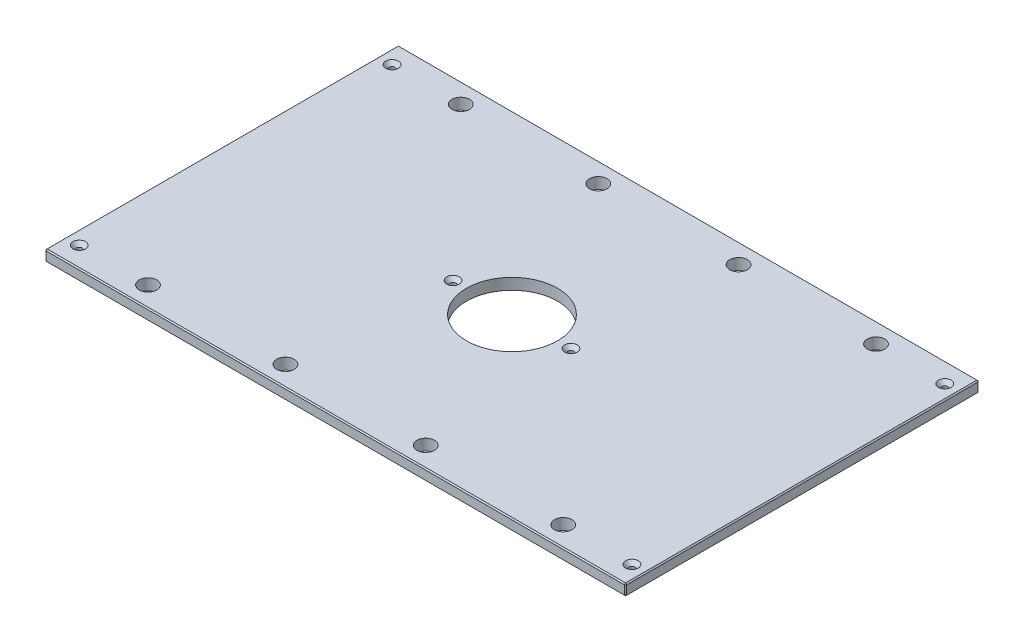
ISO-10303-21;
HEADER;
FILE_DESCRIPTION(('STEP AP214'),'2;1');
FILE_NAME('part.step','',(''),(''),'','','');
FILE_SCHEMA(('AUTOMOTIVE_DESIGN { 1 0 10303 214 1 1 1 1 }'));
ENDSEC;
DATA;
#1=APPLICATION_CONTEXT('core data for automotive mechanical design processes');
#2=APPLICATION_PROTOCOL_DEFINITION('international standard','automotive_design',2000,#1);
#3=PRODUCT_CONTEXT('',#1,'mechanical');
#4=PRODUCT('Part','Part','',(#3));
#5=PRODUCT_RELATED_PRODUCT_CATEGORY('part','',(#4));
#6=PRODUCT_DEFINITION_FORMATION('','',#4);
#7=PRODUCT_DEFINITION_CONTEXT('part definition',#1,'design');
#8=PRODUCT_DEFINITION('design','',#6,#7);
#9=PRODUCT_DEFINITION_SHAPE('','',#8);
#10=(LENGTH_UNIT() NAMED_UNIT(*) SI_UNIT(.MILLI.,.METRE.));
#11=(NAMED_UNIT(*) PLANE_ANGLE_UNIT() SI_UNIT($,.RADIAN.));
#12=(NAMED_UNIT(*) SI_UNIT($,.STERADIAN.) SOLID_ANGLE_UNIT());
#13=UNCERTAINTY_MEASURE_WITH_UNIT(LENGTH_MEASURE(1.E-05),#10,'distance_accuracy_value','');
#14=(GEOMETRIC_REPRESENTATION_CONTEXT(3) GLOBAL_UNCERTAINTY_ASSIGNED_CONTEXT((#13)) GLOBAL_UNIT_ASSIGNED_CONTEXT((#10,
#11,#12)) REPRESENTATION_CONTEXT('',''));
#15=CARTESIAN_POINT('',(0.,0.,0.));
#16=DIRECTION('',(0.,0.,1.));
#17=DIRECTION('',(1.,0.,0.));
#18=AXIS2_PLACEMENT_3D('',#15,#16,#17);
#19=CARTESIAN_POINT('',(-328.6125,12.7,-200.025));
#20=DIRECTION('',(1.,0.,0.));
#21=DIRECTION('',(0.,0.,-1.));
#22=AXIS2_PLACEMENT_3D('',#19,#20,#21);
#23=PLANE('',#22);
#24=DIRECTION('',(0.,0.,-1.));
#25=VECTOR('',#24,1.);
#26=CARTESIAN_POINT('',(-328.6125,11.43,-200.025));
#27=LINE('',#26,#25);
#28=CARTESIAN_POINT('',(-328.6125,11.43,198.755));
#29=VERTEX_POINT('',#28);
#30=CARTESIAN_POINT('',(-328.6125,11.43,-198.755));
#31=VERTEX_POINT('',#30);
#32=EDGE_CURVE('E134',#29,#31,#27,.T.);
#33=ORIENTED_EDGE('',*,*,#32,.T.);
#34=DIRECTION('',(0.,-1.,0.));
#35=VECTOR('',#34,1.);
#36=CARTESIAN_POINT('',(-328.6125,12.7,-198.755));
#37=LINE('',#36,#35);
#38=CARTESIAN_POINT('',(-328.6125,1.26999999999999,-198.755));
#39=VERTEX_POINT('',#38);
#40=EDGE_CURVE('E130',#31,#39,#37,.T.);
#41=ORIENTED_EDGE('',*,*,#40,.T.);
#42=DIRECTION('',(0.,0.,1.));
#43=VECTOR('',#42,1.);
#44=CARTESIAN_POINT('',(-328.6125,1.26999999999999,-200.025));
#45=LINE('',#44,#43);
#46=CARTESIAN_POINT('',(-328.6125,1.26999999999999,198.755));
#47=VERTEX_POINT('',#46);
#48=EDGE_CURVE('E125',#39,#47,#45,.T.);
#49=ORIENTED_EDGE('',*,*,#48,.T.);
#50=DIRECTION('',(0.,1.,0.));
#51=VECTOR('',#50,1.);
#52=CARTESIAN_POINT('',(-328.6125,12.7,198.755));
#53=LINE('',#52,#51);
#54=EDGE_CURVE('E127',#47,#29,#53,.T.);
#55=ORIENTED_EDGE('',*,*,#54,.T.);
#56=EDGE_LOOP('',(#33,#41,#49,#55));
#57=FACE_BOUND('',#56,.T.);
#58=ADVANCED_FACE('F34',(#57),#23,.F.);
#59=CARTESIAN_POINT('',(-328.6125,12.7,200.025));
#60=DIRECTION('',(0.,0.,-1.));
#61=DIRECTION('',(-1.,0.,0.));
#62=AXIS2_PLACEMENT_3D('',#59,#60,#61);
#63=PLANE('',#62);
#64=DIRECTION('',(1.,0.,0.));
#65=VECTOR('',#64,1.);
#66=CARTESIAN_POINT('',(-328.6125,1.26999999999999,200.025));
#67=LINE('',#66,#65);
#68=CARTESIAN_POINT('',(-327.3425,1.26999999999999,200.025));
#69=VERTEX_POINT('',#68);
#70=CARTESIAN_POINT('',(327.3425,1.26999999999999,200.025));
#71=VERTEX_POINT('',#70);
#72=EDGE_CURVE('E57',#69,#71,#67,.T.);
#73=ORIENTED_EDGE('',*,*,#72,.T.);
#74=DIRECTION('',(0.,1.,0.));
#75=VECTOR('',#74,1.);
#76=CARTESIAN_POINT('',(327.3425,12.7,200.025));
#77=LINE('',#76,#75);
#78=CARTESIAN_POINT('',(327.3425,11.43,200.025));
#79=VERTEX_POINT('',#78);
#80=EDGE_CURVE('E11',#71,#79,#77,.T.);
#81=ORIENTED_EDGE('',*,*,#80,.T.);
#82=DIRECTION('',(-1.,0.,0.));
#83=VECTOR('',#82,1.);
#84=CARTESIAN_POINT('',(-328.6125,11.43,200.025));
#85=LINE('',#84,#83);
#86=CARTESIAN_POINT('',(-327.3425,11.43,200.025));
#87=VERTEX_POINT('',#86);
#88=EDGE_CURVE('E43',#79,#87,#85,.T.);
#89=ORIENTED_EDGE('',*,*,#88,.T.);
#90=DIRECTION('',(0.,-1.,0.));
#91=VECTOR('',#90,1.);
#92=CARTESIAN_POINT('',(-327.3425,12.7,200.025));
#93=LINE('',#92,#91);
#94=EDGE_CURVE('E302',#87,#69,#93,.T.);
#95=ORIENTED_EDGE('',*,*,#94,.T.);
#96=EDGE_LOOP('',(#73,#81,#89,#95));
#97=FACE_BOUND('',#96,.T.);
#98=ADVANCED_FACE('F371',(#97),#63,.F.);
#99=CARTESIAN_POINT('',(328.6125,12.7,-200.025));
#100=DIRECTION('',(-1.,0.,0.));
#101=DIRECTION('',(0.,0.,1.));
#102=AXIS2_PLACEMENT_3D('',#99,#100,#101);
#103=PLANE('',#102);
#104=DIRECTION('',(0.,0.,-1.));
#105=VECTOR('',#104,1.);
#106=CARTESIAN_POINT('',(328.6125,1.26999999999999,-200.025));
#107=LINE('',#106,#105);
#108=CARTESIAN_POINT('',(328.6125,1.26999999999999,198.755));
#109=VERTEX_POINT('',#108);
#110=CARTESIAN_POINT('',(328.6125,1.26999999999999,-198.755));
#111=VERTEX_POINT('',#110);
#112=EDGE_CURVE('E297',#109,#111,#107,.T.);
#113=ORIENTED_EDGE('',*,*,#112,.T.);
#114=DIRECTION('',(0.,1.,0.));
#115=VECTOR('',#114,1.);
#116=CARTESIAN_POINT('',(328.6125,12.7,-198.755));
#117=LINE('',#116,#115);
#118=CARTESIAN_POINT('',(328.6125,11.43,-198.755));
#119=VERTEX_POINT('',#118);
#120=EDGE_CURVE('E299',#111,#119,#117,.T.);
#121=ORIENTED_EDGE('',*,*,#120,.T.);
#122=DIRECTION('',(0.,0.,1.));
#123=VECTOR('',#122,1.);
#124=CARTESIAN_POINT('',(328.6125,11.43,200.025));
#125=LINE('',#124,#123);
#126=CARTESIAN_POINT('',(328.6125,11.43,198.755));
#127=VERTEX_POINT('',#126);
#128=EDGE_CURVE('E295',#119,#127,#125,.T.);
#129=ORIENTED_EDGE('',*,*,#128,.T.);
#130=DIRECTION('',(0.,-1.,0.));
#131=VECTOR('',#130,1.);
#132=CARTESIAN_POINT('',(328.6125,12.7,198.755));
#133=LINE('',#132,#131);
#134=EDGE_CURVE('E293',#127,#109,#133,.T.);
#135=ORIENTED_EDGE('',*,*,#134,.T.);
#136=EDGE_LOOP('',(#113,#121,#129,#135));
#137=FACE_BOUND('',#136,.T.);
#138=ADVANCED_FACE('F358',(#137),#103,.F.);
#139=CARTESIAN_POINT('',(-328.6125,12.7,-200.025));
#140=DIRECTION('',(0.,0.,1.));
#141=DIRECTION('',(1.,0.,0.));
#142=AXIS2_PLACEMENT_3D('',#139,#140,#141);
#143=PLANE('',#142);
#144=DIRECTION('',(-1.,0.,0.));
#145=VECTOR('',#144,1.);
#146=CARTESIAN_POINT('',(-328.6125,1.26999999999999,-200.025));
#147=LINE('',#146,#145);
#148=CARTESIAN_POINT('',(327.3425,1.26999999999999,-200.025));
#149=VERTEX_POINT('',#148);
#150=CARTESIAN_POINT('',(-327.3425,1.26999999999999,-200.025));
#151=VERTEX_POINT('',#150);
#152=EDGE_CURVE('E269',#149,#151,#147,.T.);
#153=ORIENTED_EDGE('',*,*,#152,.T.);
#154=DIRECTION('',(0.,1.,0.));
#155=VECTOR('',#154,1.);
#156=CARTESIAN_POINT('',(-327.3425,12.7,-200.025));
#157=LINE('',#156,#155);
#158=CARTESIAN_POINT('',(-327.3425,11.43,-200.025));
#159=VERTEX_POINT('',#158);
#160=EDGE_CURVE('E273',#151,#159,#157,.T.);
#161=ORIENTED_EDGE('',*,*,#160,.T.);
#162=DIRECTION('',(1.,0.,0.));
#163=VECTOR('',#162,1.);
#164=CARTESIAN_POINT('',(328.6125,11.43,-200.025));
#165=LINE('',#164,#163);
#166=CARTESIAN_POINT('',(327.3425,11.43,-200.025));
#167=VERTEX_POINT('',#166);
#168=EDGE_CURVE('E271',#159,#167,#165,.T.);
#169=ORIENTED_EDGE('',*,*,#168,.T.);
#170=DIRECTION('',(0.,-1.,0.));
#171=VECTOR('',#170,1.);
#172=CARTESIAN_POINT('',(327.3425,12.7,-200.025));
#173=LINE('',#172,#171);
#174=EDGE_CURVE('E267',#167,#149,#173,.T.);
#175=ORIENTED_EDGE('',*,*,#174,.T.);
#176=EDGE_LOOP('',(#153,#161,#169,#175));
#177=FACE_BOUND('',#176,.T.);
#178=ADVANCED_FACE('F332',(#177),#143,.F.);
#179=CARTESIAN_POINT('',(0.,12.7,0.));
#180=DIRECTION('',(0.,1.,0.));
#181=DIRECTION('',(0.,0.,1.));
#182=AXIS2_PLACEMENT_3D('',#179,#180,#181);
#183=PLANE('',#182);
#184=CARTESIAN_POINT('',(312.7375,12.7,-177.00498));
#185=DIRECTION('',(0.,1.,0.));
#186=DIRECTION('',(0.,0.,1.));
#187=AXIS2_PLACEMENT_3D('',#184,#185,#186);
#188=CIRCLE('',#187,7.13740000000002);
#189=CARTESIAN_POINT('',(312.7375,12.7,-169.86758));
#190=VERTEX_POINT('',#189);
#191=EDGE_CURVE('E815',#190,#190,#188,.T.);
#192=ORIENTED_EDGE('',*,*,#191,.F.);
#193=EDGE_LOOP('',(#192));
#194=FACE_BOUND('',#193,.T.);
#195=CARTESIAN_POINT('',(312.7375,12.7,177.00498));
#196=DIRECTION('',(0.,1.,0.));
#197=DIRECTION('',(0.,0.,1.));
#198=AXIS2_PLACEMENT_3D('',#195,#196,#197);
#199=CIRCLE('',#198,7.13740000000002);
#200=CARTESIAN_POINT('',(312.7375,12.7,184.14238));
#201=VERTEX_POINT('',#200);
#202=EDGE_CURVE('E819',#201,#201,#199,.T.);
#203=ORIENTED_EDGE('',*,*,#202,.F.);
#204=EDGE_LOOP('',(#203));
#205=FACE_BOUND('',#204,.T.);
#206=CARTESIAN_POINT('',(-312.7375,12.7,177.00498));
#207=DIRECTION('',(0.,1.,0.));
#208=DIRECTION('',(0.,0.,1.));
#209=AXIS2_PLACEMENT_3D('',#206,#207,#208);
#210=CIRCLE('',#209,7.13740000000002);
#211=CARTESIAN_POINT('',(-312.7375,12.7,184.14238));
#212=VERTEX_POINT('',#211);
#213=EDGE_CURVE('E823',#212,#212,#210,.T.);
#214=ORIENTED_EDGE('',*,*,#213,.F.);
#215=EDGE_LOOP('',(#214));
#216=FACE_BOUND('',#215,.T.);
#217=CARTESIAN_POINT('',(-66.675,12.7,0.));
#218=DIRECTION('',(0.,1.,0.));
#219=DIRECTION('',(0.,0.,1.));
#220=AXIS2_PLACEMENT_3D('',#217,#218,#219);
#221=CIRCLE('',#220,7.1374);
#222=CARTESIAN_POINT('',(-66.675,12.7,7.1374));
#223=VERTEX_POINT('',#222);
#224=EDGE_CURVE('E827',#223,#223,#221,.T.);
#225=ORIENTED_EDGE('',*,*,#224,.F.);
#226=EDGE_LOOP('',(#225));
#227=FACE_BOUND('',#226,.T.);
#228=CARTESIAN_POINT('',(66.675,12.7,0.));
#229=DIRECTION('',(0.,1.,0.));
#230=DIRECTION('',(0.,0.,1.));
#231=AXIS2_PLACEMENT_3D('',#228,#229,#230);
#232=CIRCLE('',#231,7.1374);
#233=CARTESIAN_POINT('',(66.675,12.7,7.1374));
#234=VERTEX_POINT('',#233);
#235=EDGE_CURVE('E831',#234,#234,#232,.T.);
#236=ORIENTED_EDGE('',*,*,#235,.F.);
#237=EDGE_LOOP('',(#236));
#238=FACE_BOUND('',#237,.T.);
#239=CARTESIAN_POINT('',(-312.7375,12.7,-177.00498));
#240=DIRECTION('',(0.,1.,0.));
#241=DIRECTION('',(0.,0.,1.));
#242=AXIS2_PLACEMENT_3D('',#239,#240,#241);
#243=CIRCLE('',#242,7.13740000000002);
#244=CARTESIAN_POINT('',(-312.7375,12.7,-169.86758));
#245=VERTEX_POINT('',#244);
#246=EDGE_CURVE('E834',#245,#245,#243,.T.);
#247=ORIENTED_EDGE('',*,*,#246,.F.);
#248=EDGE_LOOP('',(#247));
#249=FACE_BOUND('',#248,.T.);
#250=DIRECTION('',(0.,0.,-1.));
#251=VECTOR('',#250,1.);
#252=CARTESIAN_POINT('',(327.3425,12.7,-200.025));
#253=LINE('',#252,#251);
#254=CARTESIAN_POINT('',(327.3425,12.7,198.755));
#255=VERTEX_POINT('',#254);
#256=CARTESIAN_POINT('',(327.3425,12.7,-198.755));
#257=VERTEX_POINT('',#256);
#258=EDGE_CURVE('E280',#255,#257,#253,.T.);
#259=ORIENTED_EDGE('',*,*,#258,.T.);
#260=DIRECTION('',(-1.,0.,0.));
#261=VECTOR('',#260,1.);
#262=CARTESIAN_POINT('',(-328.6125,12.7,-198.755));
#263=LINE('',#262,#261);
#264=CARTESIAN_POINT('',(-327.3425,12.7,-198.755));
#265=VERTEX_POINT('',#264);
#266=EDGE_CURVE('E282',#257,#265,#263,.T.);
#267=ORIENTED_EDGE('',*,*,#266,.T.);
#268=DIRECTION('',(0.,0.,1.));
#269=VECTOR('',#268,1.);
#270=CARTESIAN_POINT('',(-327.3425,12.7,200.025));
#271=LINE('',#270,#269);
#272=CARTESIAN_POINT('',(-327.3425,12.7,198.755));
#273=VERTEX_POINT('',#272);
#274=EDGE_CURVE('E278',#265,#273,#271,.T.);
#275=ORIENTED_EDGE('',*,*,#274,.T.);
#276=DIRECTION('',(1.,0.,0.));
#277=VECTOR('',#276,1.);
#278=CARTESIAN_POINT('',(328.6125,12.7,198.755));
#279=LINE('',#278,#277);
#280=EDGE_CURVE('E276',#273,#255,#279,.T.);
#281=ORIENTED_EDGE('',*,*,#280,.T.);
#282=EDGE_LOOP('',(#259,#267,#275,#281));
#283=FACE_BOUND('',#282,.T.);
#284=CARTESIAN_POINT('',(234.95,12.7,-177.00498));
#285=DIRECTION('',(0.,1.,0.));
#286=DIRECTION('',(0.,0.,1.));
#287=AXIS2_PLACEMENT_3D('',#284,#285,#286);
#288=CIRCLE('',#287,9.921875);
#289=CARTESIAN_POINT('',(234.95,12.7,-167.083105));
#290=VERTEX_POINT('',#289);
#291=EDGE_CURVE('E203',#290,#290,#288,.T.);
#292=ORIENTED_EDGE('',*,*,#291,.F.);
#293=EDGE_LOOP('',(#292));
#294=FACE_BOUND('',#293,.T.);
#295=CARTESIAN_POINT('',(-234.95,12.7,-177.00498));
#296=DIRECTION('',(0.,1.,0.));
#297=DIRECTION('',(0.,0.,1.));
#298=AXIS2_PLACEMENT_3D('',#295,#296,#297);
#299=CIRCLE('',#298,9.921875);
#300=CARTESIAN_POINT('',(-234.95,12.7,-167.083105));
#301=VERTEX_POINT('',#300);
#302=EDGE_CURVE('E213',#301,#301,#299,.T.);
#303=ORIENTED_EDGE('',*,*,#302,.F.);
#304=EDGE_LOOP('',(#303));
#305=FACE_BOUND('',#304,.T.);
#306=CARTESIAN_POINT('',(234.95,12.7,177.00498));
#307=DIRECTION('',(0.,1.,0.));
#308=DIRECTION('',(0.,0.,1.));
#309=AXIS2_PLACEMENT_3D('',#306,#307,#308);
#310=CIRCLE('',#309,9.921875);
#311=CARTESIAN_POINT('',(234.95,12.7,186.926855));
#312=VERTEX_POINT('',#311);
#313=EDGE_CURVE('E224',#312,#312,#310,.T.);
#314=ORIENTED_EDGE('',*,*,#313,.F.);
#315=EDGE_LOOP('',(#314));
#316=FACE_BOUND('',#315,.T.);
#317=CARTESIAN_POINT('',(-234.95,12.7,177.00498));
#318=DIRECTION('',(0.,1.,0.));
#319=DIRECTION('',(0.,0.,1.));
#320=AXIS2_PLACEMENT_3D('',#317,#318,#319);
#321=CIRCLE('',#320,9.921875);
#322=CARTESIAN_POINT('',(-234.95,12.7,186.926855));
#323=VERTEX_POINT('',#322);
#324=EDGE_CURVE('E230',#323,#323,#321,.T.);
#325=ORIENTED_EDGE('',*,*,#324,.F.);
#326=EDGE_LOOP('',(#325));
#327=FACE_BOUND('',#326,.T.);
#328=CARTESIAN_POINT('',(-79.375,12.7,-177.00498));
#329=DIRECTION('',(0.,1.,0.));
#330=DIRECTION('',(0.,0.,1.));
#331=AXIS2_PLACEMENT_3D('',#328,#329,#330);
#332=CIRCLE('',#331,9.921875);
#333=CARTESIAN_POINT('',(-79.375,12.7,-167.083105));
#334=VERTEX_POINT('',#333);
#335=EDGE_CURVE('E236',#334,#334,#332,.T.);
#336=ORIENTED_EDGE('',*,*,#335,.F.);
#337=EDGE_LOOP('',(#336));
#338=FACE_BOUND('',#337,.T.);
#339=CARTESIAN_POINT('',(79.375,12.7,-177.00498));
#340=DIRECTION('',(0.,1.,0.));
#341=DIRECTION('',(0.,0.,1.));
#342=AXIS2_PLACEMENT_3D('',#339,#340,#341);
#343=CIRCLE('',#342,9.921875);
#344=CARTESIAN_POINT('',(79.375,12.7,-167.083105));
#345=VERTEX_POINT('',#344);
#346=EDGE_CURVE('E242',#345,#345,#343,.T.);
#347=ORIENTED_EDGE('',*,*,#346,.F.);
#348=EDGE_LOOP('',(#347));
#349=FACE_BOUND('',#348,.T.);
#350=CARTESIAN_POINT('',(79.375,12.7,177.00498));
#351=DIRECTION('',(0.,1.,0.));
#352=DIRECTION('',(0.,0.,1.));
#353=AXIS2_PLACEMENT_3D('',#350,#351,#352);
#354=CIRCLE('',#353,9.921875);
#355=CARTESIAN_POINT('',(79.375,12.7,186.926855));
#356=VERTEX_POINT('',#355);
#357=EDGE_CURVE('E248',#356,#356,#354,.T.);
#358=ORIENTED_EDGE('',*,*,#357,.F.);
#359=EDGE_LOOP('',(#358));
#360=FACE_BOUND('',#359,.T.);
#361=CARTESIAN_POINT('',(-79.375,12.7,177.00498));
#362=DIRECTION('',(0.,1.,0.));
#363=DIRECTION('',(0.,0.,1.));
#364=AXIS2_PLACEMENT_3D('',#361,#362,#363);
#365=CIRCLE('',#364,9.921875);
#366=CARTESIAN_POINT('',(-79.375,12.7,186.926855));
#367=VERTEX_POINT('',#366);
#368=EDGE_CURVE('E254',#367,#367,#365,.T.);
#369=ORIENTED_EDGE('',*,*,#368,.F.);
#370=EDGE_LOOP('',(#369));
#371=FACE_BOUND('',#370,.T.);
#372=CARTESIAN_POINT('',(0.,12.7,0.));
#373=DIRECTION('',(0.,1.,0.));
#374=DIRECTION('',(0.,0.,1.));
#375=AXIS2_PLACEMENT_3D('',#372,#373,#374);
#376=CIRCLE('',#375,51.562);
#377=CARTESIAN_POINT('',(0.,12.7,51.562));
#378=VERTEX_POINT('',#377);
#379=EDGE_CURVE('E260',#378,#378,#376,.T.);
#380=ORIENTED_EDGE('',*,*,#379,.F.);
#381=EDGE_LOOP('',(#380));
#382=FACE_BOUND('',#381,.T.);
#383=ADVANCED_FACE('F380',(#194,#205,#216,#227,#238,#249,#283,#294,#305,#316,#327,#338,#349,
#360,#371,#382),#183,.T.);
#384=CARTESIAN_POINT('',(0.,0.,0.));
#385=DIRECTION('',(0.,1.,0.));
#386=DIRECTION('',(0.,0.,1.));
#387=AXIS2_PLACEMENT_3D('',#384,#385,#386);
#388=PLANE('',#387);
#389=CARTESIAN_POINT('',(312.7375,0.,-177.00498));
#390=DIRECTION('',(0.,1.,0.));
#391=DIRECTION('',(0.,0.,1.));
#392=AXIS2_PLACEMENT_3D('',#389,#390,#391);
#393=CIRCLE('',#392,3.3782);
#394=CARTESIAN_POINT('',(312.7375,0.,-173.62678));
#395=VERTEX_POINT('',#394);
#396=EDGE_CURVE('E868',#395,#395,#393,.T.);
#397=ORIENTED_EDGE('',*,*,#396,.T.);
#398=EDGE_LOOP('',(#397));
#399=FACE_BOUND('',#398,.T.);
#400=CARTESIAN_POINT('',(312.7375,0.,177.00498));
#401=DIRECTION('',(0.,1.,0.));
#402=DIRECTION('',(0.,0.,1.));
#403=AXIS2_PLACEMENT_3D('',#400,#401,#402);
#404=CIRCLE('',#403,3.3782);
#405=CARTESIAN_POINT('',(312.7375,0.,180.38318));
#406=VERTEX_POINT('',#405);
#407=EDGE_CURVE('E861',#406,#406,#404,.T.);
#408=ORIENTED_EDGE('',*,*,#407,.T.);
#409=EDGE_LOOP('',(#408));
#410=FACE_BOUND('',#409,.T.);
#411=CARTESIAN_POINT('',(-312.7375,0.,177.00498));
#412=DIRECTION('',(0.,1.,0.));
#413=DIRECTION('',(0.,0.,1.));
#414=AXIS2_PLACEMENT_3D('',#411,#412,#413);
#415=CIRCLE('',#414,3.3782);
#416=CARTESIAN_POINT('',(-312.7375,0.,180.38318));
#417=VERTEX_POINT('',#416);
#418=EDGE_CURVE('E854',#417,#417,#415,.T.);
#419=ORIENTED_EDGE('',*,*,#418,.T.);
#420=EDGE_LOOP('',(#419));
#421=FACE_BOUND('',#420,.T.);
#422=CARTESIAN_POINT('',(-66.675,0.,0.));
#423=DIRECTION('',(0.,1.,0.));
#424=DIRECTION('',(0.,0.,1.));
#425=AXIS2_PLACEMENT_3D('',#422,#423,#424);
#426=CIRCLE('',#425,3.3782);
#427=CARTESIAN_POINT('',(-66.675,0.,3.3782));
#428=VERTEX_POINT('',#427);
#429=EDGE_CURVE('E847',#428,#428,#426,.T.);
#430=ORIENTED_EDGE('',*,*,#429,.T.);
#431=EDGE_LOOP('',(#430));
#432=FACE_BOUND('',#431,.T.);
#433=CARTESIAN_POINT('',(66.675,0.,0.));
#434=DIRECTION('',(0.,1.,0.));
#435=DIRECTION('',(0.,0.,1.));
#436=AXIS2_PLACEMENT_3D('',#433,#434,#435);
#437=CIRCLE('',#436,3.3782);
#438=CARTESIAN_POINT('',(66.675,0.,3.3782));
#439=VERTEX_POINT('',#438);
#440=EDGE_CURVE('E837',#439,#439,#437,.T.);
#441=ORIENTED_EDGE('',*,*,#440,.T.);
#442=EDGE_LOOP('',(#441));
#443=FACE_BOUND('',#442,.T.);
#444=CARTESIAN_POINT('',(-312.7375,0.,-177.00498));
#445=DIRECTION('',(0.,1.,0.));
#446=DIRECTION('',(0.,0.,1.));
#447=AXIS2_PLACEMENT_3D('',#444,#445,#446);
#448=CIRCLE('',#447,3.3782);
#449=CARTESIAN_POINT('',(-312.7375,0.,-173.62678));
#450=VERTEX_POINT('',#449);
#451=EDGE_CURVE('E216',#450,#450,#448,.T.);
#452=ORIENTED_EDGE('',*,*,#451,.T.);
#453=EDGE_LOOP('',(#452));
#454=FACE_BOUND('',#453,.T.);
#455=DIRECTION('',(0.,0.,-1.));
#456=VECTOR('',#455,1.);
#457=CARTESIAN_POINT('',(-327.3425,0.,0.));
#458=LINE('',#457,#456);
#459=CARTESIAN_POINT('',(-327.3425,0.,198.755));
#460=VERTEX_POINT('',#459);
#461=CARTESIAN_POINT('',(-327.3425,0.,-198.755));
#462=VERTEX_POINT('',#461);
#463=EDGE_CURVE('E157',#460,#462,#458,.T.);
#464=ORIENTED_EDGE('',*,*,#463,.T.);
#465=DIRECTION('',(1.,0.,0.));
#466=VECTOR('',#465,1.);
#467=CARTESIAN_POINT('',(0.,0.,-198.755));
#468=LINE('',#467,#466);
#469=CARTESIAN_POINT('',(327.3425,0.,-198.755));
#470=VERTEX_POINT('',#469);
#471=EDGE_CURVE('E290',#462,#470,#468,.T.);
#472=ORIENTED_EDGE('',*,*,#471,.T.);
#473=DIRECTION('',(0.,0.,1.));
#474=VECTOR('',#473,1.);
#475=CARTESIAN_POINT('',(327.3425,0.,0.));
#476=LINE('',#475,#474);
#477=CARTESIAN_POINT('',(327.3425,0.,198.755));
#478=VERTEX_POINT('',#477);
#479=EDGE_CURVE('E288',#470,#478,#476,.T.);
#480=ORIENTED_EDGE('',*,*,#479,.T.);
#481=DIRECTION('',(-1.,0.,0.));
#482=VECTOR('',#481,1.);
#483=CARTESIAN_POINT('',(0.,0.,198.755));
#484=LINE('',#483,#482);
#485=EDGE_CURVE('E285',#478,#460,#484,.T.);
#486=ORIENTED_EDGE('',*,*,#485,.T.);
#487=EDGE_LOOP('',(#464,#472,#480,#486));
#488=FACE_BOUND('',#487,.T.);
#489=CARTESIAN_POINT('',(234.95,0.,-177.00498));
#490=DIRECTION('',(0.,1.,0.));
#491=DIRECTION('',(0.,0.,1.));
#492=AXIS2_PLACEMENT_3D('',#489,#490,#491);
#493=CIRCLE('',#492,9.921875);
#494=CARTESIAN_POINT('',(234.95,0.,-167.083105));
#495=VERTEX_POINT('',#494);
#496=EDGE_CURVE('E208',#495,#495,#493,.T.);
#497=ORIENTED_EDGE('',*,*,#496,.T.);
#498=EDGE_LOOP('',(#497));
#499=FACE_BOUND('',#498,.T.);
#500=CARTESIAN_POINT('',(-234.95,0.,-177.00498));
#501=DIRECTION('',(0.,1.,0.));
#502=DIRECTION('',(0.,0.,1.));
#503=AXIS2_PLACEMENT_3D('',#500,#501,#502);
#504=CIRCLE('',#503,9.921875);
#505=CARTESIAN_POINT('',(-234.95,0.,-167.083105));
#506=VERTEX_POINT('',#505);
#507=EDGE_CURVE('E221',#506,#506,#504,.T.);
#508=ORIENTED_EDGE('',*,*,#507,.T.);
#509=EDGE_LOOP('',(#508));
#510=FACE_BOUND('',#509,.T.);
#511=CARTESIAN_POINT('',(234.95,0.,177.00498));
#512=DIRECTION('',(0.,1.,0.));
#513=DIRECTION('',(0.,0.,1.));
#514=AXIS2_PLACEMENT_3D('',#511,#512,#513);
#515=CIRCLE('',#514,9.921875);
#516=CARTESIAN_POINT('',(234.95,0.,186.926855));
#517=VERTEX_POINT('',#516);
#518=EDGE_CURVE('E227',#517,#517,#515,.T.);
#519=ORIENTED_EDGE('',*,*,#518,.T.);
#520=EDGE_LOOP('',(#519));
#521=FACE_BOUND('',#520,.T.);
#522=CARTESIAN_POINT('',(-234.95,0.,177.00498));
#523=DIRECTION('',(0.,1.,0.));
#524=DIRECTION('',(0.,0.,1.));
#525=AXIS2_PLACEMENT_3D('',#522,#523,#524);
#526=CIRCLE('',#525,9.921875);
#527=CARTESIAN_POINT('',(-234.95,0.,186.926855));
#528=VERTEX_POINT('',#527);
#529=EDGE_CURVE('E233',#528,#528,#526,.T.);
#530=ORIENTED_EDGE('',*,*,#529,.T.);
#531=EDGE_LOOP('',(#530));
#532=FACE_BOUND('',#531,.T.);
#533=CARTESIAN_POINT('',(-79.375,0.,-177.00498));
#534=DIRECTION('',(0.,1.,0.));
#535=DIRECTION('',(0.,0.,1.));
#536=AXIS2_PLACEMENT_3D('',#533,#534,#535);
#537=CIRCLE('',#536,9.921875);
#538=CARTESIAN_POINT('',(-79.375,0.,-167.083105));
#539=VERTEX_POINT('',#538);
#540=EDGE_CURVE('E239',#539,#539,#537,.T.);
#541=ORIENTED_EDGE('',*,*,#540,.T.);
#542=EDGE_LOOP('',(#541));
#543=FACE_BOUND('',#542,.T.);
#544=CARTESIAN_POINT('',(79.375,0.,-177.00498));
#545=DIRECTION('',(0.,1.,0.));
#546=DIRECTION('',(0.,0.,1.));
#547=AXIS2_PLACEMENT_3D('',#544,#545,#546);
#548=CIRCLE('',#547,9.921875);
#549=CARTESIAN_POINT('',(79.375,0.,-167.083105));
#550=VERTEX_POINT('',#549);
#551=EDGE_CURVE('E245',#550,#550,#548,.T.);
#552=ORIENTED_EDGE('',*,*,#551,.T.);
#553=EDGE_LOOP('',(#552));
#554=FACE_BOUND('',#553,.T.);
#555=CARTESIAN_POINT('',(79.375,0.,177.00498));
#556=DIRECTION('',(0.,1.,0.));
#557=DIRECTION('',(0.,0.,1.));
#558=AXIS2_PLACEMENT_3D('',#555,#556,#557);
#559=CIRCLE('',#558,9.921875);
#560=CARTESIAN_POINT('',(79.375,0.,186.926855));
#561=VERTEX_POINT('',#560);
#562=EDGE_CURVE('E251',#561,#561,#559,.T.);
#563=ORIENTED_EDGE('',*,*,#562,.T.);
#564=EDGE_LOOP('',(#563));
#565=FACE_BOUND('',#564,.T.);
#566=CARTESIAN_POINT('',(-79.375,0.,177.00498));
#567=DIRECTION('',(0.,1.,0.));
#568=DIRECTION('',(0.,0.,1.));
#569=AXIS2_PLACEMENT_3D('',#566,#567,#568);
#570=CIRCLE('',#569,9.921875);
#571=CARTESIAN_POINT('',(-79.375,0.,186.926855));
#572=VERTEX_POINT('',#571);
#573=EDGE_CURVE('E257',#572,#572,#570,.T.);
#574=ORIENTED_EDGE('',*,*,#573,.T.);
#575=EDGE_LOOP('',(#574));
#576=FACE_BOUND('',#575,.T.);
#577=CARTESIAN_POINT('',(0.,0.,0.));
#578=DIRECTION('',(0.,1.,0.));
#579=DIRECTION('',(0.,0.,1.));
#580=AXIS2_PLACEMENT_3D('',#577,#578,#579);
#581=CIRCLE('',#580,51.562);
#582=CARTESIAN_POINT('',(0.,0.,51.562));
#583=VERTEX_POINT('',#582);
#584=EDGE_CURVE('E146',#583,#583,#581,.T.);
#585=ORIENTED_EDGE('',*,*,#584,.T.);
#586=EDGE_LOOP('',(#585));
#587=FACE_BOUND('',#586,.T.);
#588=ADVANCED_FACE('F345',(#399,#410,#421,#432,#443,#454,#488,#499,#510,#521,#532,#543,#554,
#565,#576,#587),#388,.F.);
#589=CARTESIAN_POINT('',(0.,0.,0.));
#590=DIRECTION('',(0.,1.,0.));
#591=DIRECTION('',(0.,0.,1.));
#592=AXIS2_PLACEMENT_3D('',#589,#590,#591);
#593=CYLINDRICAL_SURFACE('',#592,51.562);
#594=ORIENTED_EDGE('',*,*,#584,.F.);
#595=EDGE_LOOP('',(#594));
#596=FACE_BOUND('',#595,.T.);
#597=ORIENTED_EDGE('',*,*,#379,.T.);
#598=EDGE_LOOP('',(#597));
#599=FACE_BOUND('',#598,.T.);
#600=ADVANCED_FACE('F750',(#596,#599),#593,.F.);
#601=CARTESIAN_POINT('',(-79.375,12.7,177.00498));
#602=DIRECTION('',(0.,1.,0.));
#603=DIRECTION('',(0.,0.,1.));
#604=AXIS2_PLACEMENT_3D('',#601,#602,#603);
#605=CYLINDRICAL_SURFACE('',#604,9.921875);
#606=ORIENTED_EDGE('',*,*,#573,.F.);
#607=EDGE_LOOP('',(#606));
#608=FACE_BOUND('',#607,.T.);
#609=ORIENTED_EDGE('',*,*,#368,.T.);
#610=EDGE_LOOP('',(#609));
#611=FACE_BOUND('',#610,.T.);
#612=ADVANCED_FACE('F741',(#608,#611),#605,.F.);
#613=CARTESIAN_POINT('',(79.375,12.7,177.00498));
#614=DIRECTION('',(0.,1.,0.));
#615=DIRECTION('',(0.,0.,1.));
#616=AXIS2_PLACEMENT_3D('',#613,#614,#615);
#617=CYLINDRICAL_SURFACE('',#616,9.921875);
#618=ORIENTED_EDGE('',*,*,#562,.F.);
#619=EDGE_LOOP('',(#618));
#620=FACE_BOUND('',#619,.T.);
#621=ORIENTED_EDGE('',*,*,#357,.T.);
#622=EDGE_LOOP('',(#621));
#623=FACE_BOUND('',#622,.T.);
#624=ADVANCED_FACE('F732',(#620,#623),#617,.F.);
#625=CARTESIAN_POINT('',(79.375,12.7,-177.00498));
#626=DIRECTION('',(0.,1.,0.));
#627=DIRECTION('',(0.,0.,1.));
#628=AXIS2_PLACEMENT_3D('',#625,#626,#627);
#629=CYLINDRICAL_SURFACE('',#628,9.921875);
#630=ORIENTED_EDGE('',*,*,#551,.F.);
#631=EDGE_LOOP('',(#630));
#632=FACE_BOUND('',#631,.T.);
#633=ORIENTED_EDGE('',*,*,#346,.T.);
#634=EDGE_LOOP('',(#633));
#635=FACE_BOUND('',#634,.T.);
#636=ADVANCED_FACE('F723',(#632,#635),#629,.F.);
#637=CARTESIAN_POINT('',(-79.375,12.7,-177.00498));
#638=DIRECTION('',(0.,1.,0.));
#639=DIRECTION('',(0.,0.,1.));
#640=AXIS2_PLACEMENT_3D('',#637,#638,#639);
#641=CYLINDRICAL_SURFACE('',#640,9.921875);
#642=ORIENTED_EDGE('',*,*,#540,.F.);
#643=EDGE_LOOP('',(#642));
#644=FACE_BOUND('',#643,.T.);
#645=ORIENTED_EDGE('',*,*,#335,.T.);
#646=EDGE_LOOP('',(#645));
#647=FACE_BOUND('',#646,.T.);
#648=ADVANCED_FACE('F714',(#644,#647),#641,.F.);
#649=CARTESIAN_POINT('',(-234.95,12.7,177.00498));
#650=DIRECTION('',(0.,1.,0.));
#651=DIRECTION('',(0.,0.,1.));
#652=AXIS2_PLACEMENT_3D('',#649,#650,#651);
#653=CYLINDRICAL_SURFACE('',#652,9.921875);
#654=ORIENTED_EDGE('',*,*,#529,.F.);
#655=EDGE_LOOP('',(#654));
#656=FACE_BOUND('',#655,.T.);
#657=ORIENTED_EDGE('',*,*,#324,.T.);
#658=EDGE_LOOP('',(#657));
#659=FACE_BOUND('',#658,.T.);
#660=ADVANCED_FACE('F705',(#656,#659),#653,.F.);
#661=CARTESIAN_POINT('',(234.95,12.7,177.00498));
#662=DIRECTION('',(0.,1.,0.));
#663=DIRECTION('',(0.,0.,1.));
#664=AXIS2_PLACEMENT_3D('',#661,#662,#663);
#665=CYLINDRICAL_SURFACE('',#664,9.921875);
#666=ORIENTED_EDGE('',*,*,#518,.F.);
#667=EDGE_LOOP('',(#666));
#668=FACE_BOUND('',#667,.T.);
#669=ORIENTED_EDGE('',*,*,#313,.T.);
#670=EDGE_LOOP('',(#669));
#671=FACE_BOUND('',#670,.T.);
#672=ADVANCED_FACE('F696',(#668,#671),#665,.F.);
#673=CARTESIAN_POINT('',(-234.95,12.7,-177.00498));
#674=DIRECTION('',(0.,1.,0.));
#675=DIRECTION('',(0.,0.,1.));
#676=AXIS2_PLACEMENT_3D('',#673,#674,#675);
#677=CYLINDRICAL_SURFACE('',#676,9.921875);
#678=ORIENTED_EDGE('',*,*,#507,.F.);
#679=EDGE_LOOP('',(#678));
#680=FACE_BOUND('',#679,.T.);
#681=ORIENTED_EDGE('',*,*,#302,.T.);
#682=EDGE_LOOP('',(#681));
#683=FACE_BOUND('',#682,.T.);
#684=ADVANCED_FACE('F686',(#680,#683),#677,.F.);
#685=CARTESIAN_POINT('',(234.95,12.7,-177.00498));
#686=DIRECTION('',(0.,1.,0.));
#687=DIRECTION('',(0.,0.,1.));
#688=AXIS2_PLACEMENT_3D('',#685,#686,#687);
#689=CYLINDRICAL_SURFACE('',#688,9.921875);
#690=ORIENTED_EDGE('',*,*,#496,.F.);
#691=EDGE_LOOP('',(#690));
#692=FACE_BOUND('',#691,.T.);
#693=ORIENTED_EDGE('',*,*,#291,.T.);
#694=EDGE_LOOP('',(#693));
#695=FACE_BOUND('',#694,.T.);
#696=ADVANCED_FACE('F389',(#692,#695),#689,.F.);
#697=CARTESIAN_POINT('',(328.6125,12.7,198.755));
#698=DIRECTION('',(-0.707106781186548,0.,-0.707106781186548));
#699=DIRECTION('',(0.,-1.,0.));
#700=AXIS2_PLACEMENT_3D('',#697,#698,#699);
#701=PLANE('',#700);
#702=DIRECTION('',(-0.707106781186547,0.,0.707106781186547));
#703=VECTOR('',#702,1.);
#704=CARTESIAN_POINT('',(328.6125,11.43,198.755));
#705=LINE('',#704,#703);
#706=EDGE_CURVE('E38',#79,#127,#705,.F.);
#707=ORIENTED_EDGE('',*,*,#706,.F.);
#708=ORIENTED_EDGE('',*,*,#80,.F.);
#709=DIRECTION('',(0.707106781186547,0.,-0.707106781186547));
#710=VECTOR('',#709,1.);
#711=CARTESIAN_POINT('',(327.9775,1.26999999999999,199.39));
#712=LINE('',#711,#710);
#713=EDGE_CURVE('E196',#109,#71,#712,.F.);
#714=ORIENTED_EDGE('',*,*,#713,.F.);
#715=ORIENTED_EDGE('',*,*,#134,.F.);
#716=EDGE_LOOP('',(#707,#708,#714,#715));
#717=FACE_BOUND('',#716,.T.);
#718=ADVANCED_FACE('F36',(#717),#701,.F.);
#719=CARTESIAN_POINT('',(328.6125,11.43,198.755));
#720=DIRECTION('',(0.577350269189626,0.577350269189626,0.577350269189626));
#721=DIRECTION('',(0.707106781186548,0.,-0.707106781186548));
#722=AXIS2_PLACEMENT_3D('',#719,#720,#721);
#723=PLANE('',#722);
#724=DIRECTION('',(0.,-0.707106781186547,0.707106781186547));
#725=VECTOR('',#724,1.);
#726=CARTESIAN_POINT('',(327.3425,12.065,199.39));
#727=LINE('',#726,#725);
#728=EDGE_CURVE('E192',#79,#255,#727,.F.);
#729=ORIENTED_EDGE('',*,*,#728,.F.);
#730=ORIENTED_EDGE('',*,*,#706,.T.);
#731=DIRECTION('',(-0.707106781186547,0.707106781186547,0.));
#732=VECTOR('',#731,1.);
#733=CARTESIAN_POINT('',(328.6125,11.43,198.755));
#734=LINE('',#733,#732);
#735=EDGE_CURVE('E194',#255,#127,#734,.F.);
#736=ORIENTED_EDGE('',*,*,#735,.F.);
#737=EDGE_LOOP('',(#729,#730,#736));
#738=FACE_BOUND('',#737,.T.);
#739=ADVANCED_FACE('F382',(#738),#723,.T.);
#740=CARTESIAN_POINT('',(327.3425,0.,198.755));
#741=DIRECTION('',(0.577350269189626,-0.577350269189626,0.577350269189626));
#742=DIRECTION('',(0.707106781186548,0.,-0.707106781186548));
#743=AXIS2_PLACEMENT_3D('',#740,#741,#742);
#744=PLANE('',#743);
#745=DIRECTION('',(-0.707106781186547,-0.707106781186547,0.));
#746=VECTOR('',#745,1.);
#747=CARTESIAN_POINT('',(327.3425,0.,198.755));
#748=LINE('',#747,#746);
#749=EDGE_CURVE('E186',#109,#478,#748,.T.);
#750=ORIENTED_EDGE('',*,*,#749,.F.);
#751=ORIENTED_EDGE('',*,*,#713,.T.);
#752=DIRECTION('',(0.,0.707106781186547,0.707106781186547));
#753=VECTOR('',#752,1.);
#754=CARTESIAN_POINT('',(327.3425,0.,198.755));
#755=LINE('',#754,#753);
#756=EDGE_CURVE('E189',#478,#71,#755,.T.);
#757=ORIENTED_EDGE('',*,*,#756,.F.);
#758=EDGE_LOOP('',(#750,#751,#757));
#759=FACE_BOUND('',#758,.T.);
#760=ADVANCED_FACE('F351',(#759),#744,.T.);
#761=CARTESIAN_POINT('',(327.3425,12.7,0.));
#762=DIRECTION('',(0.707106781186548,0.707106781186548,0.));
#763=DIRECTION('',(0.,0.,1.));
#764=AXIS2_PLACEMENT_3D('',#761,#762,#763);
#765=PLANE('',#764);
#766=ORIENTED_EDGE('',*,*,#735,.T.);
#767=ORIENTED_EDGE('',*,*,#128,.F.);
#768=DIRECTION('',(0.707106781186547,-0.707106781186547,0.));
#769=VECTOR('',#768,1.);
#770=CARTESIAN_POINT('',(327.9775,12.065,-198.755));
#771=LINE('',#770,#769);
#772=EDGE_CURVE('E181',#257,#119,#771,.T.);
#773=ORIENTED_EDGE('',*,*,#772,.F.);
#774=ORIENTED_EDGE('',*,*,#258,.F.);
#775=EDGE_LOOP('',(#766,#767,#773,#774));
#776=FACE_BOUND('',#775,.T.);
#777=ADVANCED_FACE('F368',(#776),#765,.T.);
#778=CARTESIAN_POINT('',(0.,12.7,198.755));
#779=DIRECTION('',(0.,0.707106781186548,0.707106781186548));
#780=DIRECTION('',(-1.,0.,0.));
#781=AXIS2_PLACEMENT_3D('',#778,#779,#780);
#782=PLANE('',#781);
#783=ORIENTED_EDGE('',*,*,#728,.T.);
#784=ORIENTED_EDGE('',*,*,#280,.F.);
#785=DIRECTION('',(0.,0.707106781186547,-0.707106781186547));
#786=VECTOR('',#785,1.);
#787=CARTESIAN_POINT('',(-327.3425,12.7,198.755));
#788=LINE('',#787,#786);
#789=EDGE_CURVE('E178',#87,#273,#788,.T.);
#790=ORIENTED_EDGE('',*,*,#789,.F.);
#791=ORIENTED_EDGE('',*,*,#88,.F.);
#792=EDGE_LOOP('',(#783,#784,#790,#791));
#793=FACE_BOUND('',#792,.T.);
#794=ADVANCED_FACE('F373',(#793),#782,.T.);
#795=CARTESIAN_POINT('',(-327.3425,12.7,200.025));
#796=DIRECTION('',(0.707106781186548,0.,-0.707106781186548));
#797=DIRECTION('',(0.,-1.,0.));
#798=AXIS2_PLACEMENT_3D('',#795,#796,#797);
#799=PLANE('',#798);
#800=DIRECTION('',(0.707106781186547,0.,0.707106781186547));
#801=VECTOR('',#800,1.);
#802=CARTESIAN_POINT('',(-328.6125,1.26999999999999,198.755));
#803=LINE('',#802,#801);
#804=EDGE_CURVE('E141',#69,#47,#803,.F.);
#805=ORIENTED_EDGE('',*,*,#804,.F.);
#806=ORIENTED_EDGE('',*,*,#94,.F.);
#807=DIRECTION('',(-0.707106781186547,0.,-0.707106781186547));
#808=VECTOR('',#807,1.);
#809=CARTESIAN_POINT('',(-327.9775,11.43,199.39));
#810=LINE('',#809,#808);
#811=EDGE_CURVE('E144',#29,#87,#810,.F.);
#812=ORIENTED_EDGE('',*,*,#811,.F.);
#813=ORIENTED_EDGE('',*,*,#54,.F.);
#814=EDGE_LOOP('',(#805,#806,#812,#813));
#815=FACE_BOUND('',#814,.T.);
#816=ADVANCED_FACE('F139',(#815),#799,.F.);
#817=CARTESIAN_POINT('',(-328.6125,1.26999999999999,200.025));
#818=DIRECTION('',(0.,0.707106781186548,-0.707106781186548));
#819=DIRECTION('',(1.,0.,0.));
#820=AXIS2_PLACEMENT_3D('',#817,#818,#819);
#821=PLANE('',#820);
#822=ORIENTED_EDGE('',*,*,#756,.T.);
#823=ORIENTED_EDGE('',*,*,#72,.F.);
#824=DIRECTION('',(0.,-0.707106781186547,-0.707106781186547));
#825=VECTOR('',#824,1.);
#826=CARTESIAN_POINT('',(-327.3425,0.634999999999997,199.39));
#827=LINE('',#826,#825);
#828=EDGE_CURVE('E154',#460,#69,#827,.F.);
#829=ORIENTED_EDGE('',*,*,#828,.F.);
#830=ORIENTED_EDGE('',*,*,#485,.F.);
#831=EDGE_LOOP('',(#822,#823,#829,#830));
#832=FACE_BOUND('',#831,.T.);
#833=ADVANCED_FACE('F350',(#832),#821,.F.);
#834=CARTESIAN_POINT('',(328.6125,1.26999999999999,-200.025));
#835=DIRECTION('',(-0.707106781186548,0.707106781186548,0.));
#836=DIRECTION('',(0.,0.,-1.));
#837=AXIS2_PLACEMENT_3D('',#834,#835,#836);
#838=PLANE('',#837);
#839=ORIENTED_EDGE('',*,*,#749,.T.);
#840=ORIENTED_EDGE('',*,*,#479,.F.);
#841=DIRECTION('',(0.707106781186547,0.707106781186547,0.));
#842=VECTOR('',#841,1.);
#843=CARTESIAN_POINT('',(327.3425,0.,-198.755));
#844=LINE('',#843,#842);
#845=EDGE_CURVE('E173',#111,#470,#844,.F.);
#846=ORIENTED_EDGE('',*,*,#845,.F.);
#847=ORIENTED_EDGE('',*,*,#112,.F.);
#848=EDGE_LOOP('',(#839,#840,#846,#847));
#849=FACE_BOUND('',#848,.T.);
#850=ADVANCED_FACE('F355',(#849),#838,.F.);
#851=CARTESIAN_POINT('',(327.3425,12.7,-200.025));
#852=DIRECTION('',(-0.707106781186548,0.,0.707106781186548));
#853=DIRECTION('',(0.,-1.,0.));
#854=AXIS2_PLACEMENT_3D('',#851,#852,#853);
#855=PLANE('',#854);
#856=DIRECTION('',(0.707106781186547,0.,0.707106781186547));
#857=VECTOR('',#856,1.);
#858=CARTESIAN_POINT('',(327.3425,11.43,-200.025));
#859=LINE('',#858,#857);
#860=EDGE_CURVE('E183',#119,#167,#859,.F.);
#861=ORIENTED_EDGE('',*,*,#860,.F.);
#862=ORIENTED_EDGE('',*,*,#120,.F.);
#863=DIRECTION('',(-0.707106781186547,0.,-0.707106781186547));
#864=VECTOR('',#863,1.);
#865=CARTESIAN_POINT('',(327.9775,1.26999999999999,-199.39));
#866=LINE('',#865,#864);
#867=EDGE_CURVE('E170',#149,#111,#866,.F.);
#868=ORIENTED_EDGE('',*,*,#867,.F.);
#869=ORIENTED_EDGE('',*,*,#174,.F.);
#870=EDGE_LOOP('',(#861,#862,#868,#869));
#871=FACE_BOUND('',#870,.T.);
#872=ADVANCED_FACE('F363',(#871),#855,.F.);
#873=CARTESIAN_POINT('',(327.3425,11.43,-200.025));
#874=DIRECTION('',(0.577350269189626,0.577350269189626,-0.577350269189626));
#875=DIRECTION('',(-0.707106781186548,0.,-0.707106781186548));
#876=AXIS2_PLACEMENT_3D('',#873,#874,#875);
#877=PLANE('',#876);
#878=ORIENTED_EDGE('',*,*,#772,.T.);
#879=ORIENTED_EDGE('',*,*,#860,.T.);
#880=DIRECTION('',(0.,0.707106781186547,0.707106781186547));
#881=VECTOR('',#880,1.);
#882=CARTESIAN_POINT('',(327.3425,11.43,-200.025));
#883=LINE('',#882,#881);
#884=EDGE_CURVE('E162',#257,#167,#883,.F.);
#885=ORIENTED_EDGE('',*,*,#884,.F.);
#886=EDGE_LOOP('',(#878,#879,#885));
#887=FACE_BOUND('',#886,.T.);
#888=ADVANCED_FACE('F421',(#887),#877,.T.);
#889=CARTESIAN_POINT('',(-327.3425,12.7,198.755));
#890=DIRECTION('',(-0.577350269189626,0.577350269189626,0.577350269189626));
#891=DIRECTION('',(0.707106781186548,0.,0.707106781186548));
#892=AXIS2_PLACEMENT_3D('',#889,#890,#891);
#893=PLANE('',#892);
#894=ORIENTED_EDGE('',*,*,#811,.T.);
#895=ORIENTED_EDGE('',*,*,#789,.T.);
#896=DIRECTION('',(-0.707106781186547,-0.707106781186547,0.));
#897=VECTOR('',#896,1.);
#898=CARTESIAN_POINT('',(-327.3425,12.7,198.755));
#899=LINE('',#898,#897);
#900=EDGE_CURVE('E158',#29,#273,#899,.F.);
#901=ORIENTED_EDGE('',*,*,#900,.F.);
#902=EDGE_LOOP('',(#894,#895,#901));
#903=FACE_BOUND('',#902,.T.);
#904=ADVANCED_FACE('F375',(#903),#893,.T.);
#905=CARTESIAN_POINT('',(-328.6125,1.26999999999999,198.755));
#906=DIRECTION('',(-0.577350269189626,-0.577350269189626,0.577350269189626));
#907=DIRECTION('',(0.707106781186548,0.,0.707106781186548));
#908=AXIS2_PLACEMENT_3D('',#905,#906,#907);
#909=PLANE('',#908);
#910=ORIENTED_EDGE('',*,*,#828,.T.);
#911=ORIENTED_EDGE('',*,*,#804,.T.);
#912=DIRECTION('',(-0.707106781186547,0.707106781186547,0.));
#913=VECTOR('',#912,1.);
#914=CARTESIAN_POINT('',(-328.6125,1.26999999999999,198.755));
#915=LINE('',#914,#913);
#916=EDGE_CURVE('E151',#460,#47,#915,.T.);
#917=ORIENTED_EDGE('',*,*,#916,.F.);
#918=EDGE_LOOP('',(#910,#911,#917));
#919=FACE_BOUND('',#918,.T.);
#920=ADVANCED_FACE('F150',(#919),#909,.T.);
#921=CARTESIAN_POINT('',(327.3425,0.,-198.755));
#922=DIRECTION('',(0.577350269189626,-0.577350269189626,-0.577350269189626));
#923=DIRECTION('',(-0.707106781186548,0.,-0.707106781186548));
#924=AXIS2_PLACEMENT_3D('',#921,#922,#923);
#925=PLANE('',#924);
#926=ORIENTED_EDGE('',*,*,#867,.T.);
#927=ORIENTED_EDGE('',*,*,#845,.T.);
#928=DIRECTION('',(0.,-0.707106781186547,0.707106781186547));
#929=VECTOR('',#928,1.);
#930=CARTESIAN_POINT('',(327.3425,0.,-198.755));
#931=LINE('',#930,#929);
#932=EDGE_CURVE('E159',#149,#470,#931,.T.);
#933=ORIENTED_EDGE('',*,*,#932,.F.);
#934=EDGE_LOOP('',(#926,#927,#933));
#935=FACE_BOUND('',#934,.T.);
#936=ADVANCED_FACE('F413',(#935),#925,.T.);
#937=CARTESIAN_POINT('',(0.,12.7,-198.755));
#938=DIRECTION('',(0.,0.707106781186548,-0.707106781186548));
#939=DIRECTION('',(1.,0.,0.));
#940=AXIS2_PLACEMENT_3D('',#937,#938,#939);
#941=PLANE('',#940);
#942=ORIENTED_EDGE('',*,*,#884,.T.);
#943=ORIENTED_EDGE('',*,*,#168,.F.);
#944=DIRECTION('',(0.,-0.707106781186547,-0.707106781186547));
#945=VECTOR('',#944,1.);
#946=CARTESIAN_POINT('',(-327.3425,11.43,-200.025));
#947=LINE('',#946,#945);
#948=EDGE_CURVE('E164',#265,#159,#947,.T.);
#949=ORIENTED_EDGE('',*,*,#948,.F.);
#950=ORIENTED_EDGE('',*,*,#266,.F.);
#951=EDGE_LOOP('',(#942,#943,#949,#950));
#952=FACE_BOUND('',#951,.T.);
#953=ADVANCED_FACE('F327',(#952),#941,.T.);
#954=CARTESIAN_POINT('',(-327.3425,12.7,0.));
#955=DIRECTION('',(-0.707106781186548,0.707106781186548,0.));
#956=DIRECTION('',(0.,0.,-1.));
#957=AXIS2_PLACEMENT_3D('',#954,#955,#956);
#958=PLANE('',#957);
#959=ORIENTED_EDGE('',*,*,#900,.T.);
#960=ORIENTED_EDGE('',*,*,#274,.F.);
#961=DIRECTION('',(0.707106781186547,0.707106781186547,0.));
#962=VECTOR('',#961,1.);
#963=CARTESIAN_POINT('',(-327.9775,12.065,-198.755));
#964=LINE('',#963,#962);
#965=EDGE_CURVE('E316',#31,#265,#964,.T.);
#966=ORIENTED_EDGE('',*,*,#965,.F.);
#967=ORIENTED_EDGE('',*,*,#32,.F.);
#968=EDGE_LOOP('',(#959,#960,#966,#967));
#969=FACE_BOUND('',#968,.T.);
#970=ADVANCED_FACE('F378',(#969),#958,.T.);
#971=CARTESIAN_POINT('',(-328.6125,1.26999999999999,-200.025));
#972=DIRECTION('',(0.707106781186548,0.707106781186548,0.));
#973=DIRECTION('',(0.,0.,1.));
#974=AXIS2_PLACEMENT_3D('',#971,#972,#973);
#975=PLANE('',#974);
#976=ORIENTED_EDGE('',*,*,#916,.T.);
#977=ORIENTED_EDGE('',*,*,#48,.F.);
#978=DIRECTION('',(0.707106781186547,-0.707106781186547,0.));
#979=VECTOR('',#978,1.);
#980=CARTESIAN_POINT('',(-328.6125,1.26999999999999,-198.755));
#981=LINE('',#980,#979);
#982=EDGE_CURVE('E313',#462,#39,#981,.F.);
#983=ORIENTED_EDGE('',*,*,#982,.F.);
#984=ORIENTED_EDGE('',*,*,#463,.F.);
#985=EDGE_LOOP('',(#976,#977,#983,#984));
#986=FACE_BOUND('',#985,.T.);
#987=ADVANCED_FACE('F156',(#986),#975,.F.);
#988=CARTESIAN_POINT('',(-328.6125,1.26999999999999,-200.025));
#989=DIRECTION('',(0.,0.707106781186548,0.707106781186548));
#990=DIRECTION('',(-1.,0.,0.));
#991=AXIS2_PLACEMENT_3D('',#988,#989,#990);
#992=PLANE('',#991);
#993=ORIENTED_EDGE('',*,*,#932,.T.);
#994=ORIENTED_EDGE('',*,*,#471,.F.);
#995=DIRECTION('',(0.,0.707106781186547,-0.707106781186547));
#996=VECTOR('',#995,1.);
#997=CARTESIAN_POINT('',(-327.3425,0.634999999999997,-199.39));
#998=LINE('',#997,#996);
#999=EDGE_CURVE('E310',#151,#462,#998,.F.);
#1000=ORIENTED_EDGE('',*,*,#999,.F.);
#1001=ORIENTED_EDGE('',*,*,#152,.F.);
#1002=EDGE_LOOP('',(#993,#994,#1000,#1001));
#1003=FACE_BOUND('',#1002,.T.);
#1004=ADVANCED_FACE('F342',(#1003),#992,.F.);
#1005=CARTESIAN_POINT('',(-327.3425,11.43,-200.025));
#1006=DIRECTION('',(-0.577350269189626,0.577350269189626,-0.577350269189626));
#1007=DIRECTION('',(-0.707106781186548,0.,0.707106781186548));
#1008=AXIS2_PLACEMENT_3D('',#1005,#1006,#1007);
#1009=PLANE('',#1008);
#1010=ORIENTED_EDGE('',*,*,#965,.T.);
#1011=ORIENTED_EDGE('',*,*,#948,.T.);
#1012=DIRECTION('',(0.707106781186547,0.,-0.707106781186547));
#1013=VECTOR('',#1012,1.);
#1014=CARTESIAN_POINT('',(-327.3425,11.43,-200.025));
#1015=LINE('',#1014,#1013);
#1016=EDGE_CURVE('E308',#31,#159,#1015,.T.);
#1017=ORIENTED_EDGE('',*,*,#1016,.F.);
#1018=EDGE_LOOP('',(#1010,#1011,#1017));
#1019=FACE_BOUND('',#1018,.T.);
#1020=ADVANCED_FACE('F322',(#1019),#1009,.T.);
#1021=CARTESIAN_POINT('',(-328.6125,1.26999999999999,-198.755));
#1022=DIRECTION('',(-0.577350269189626,-0.577350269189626,-0.577350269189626));
#1023=DIRECTION('',(-0.707106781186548,0.,0.707106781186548));
#1024=AXIS2_PLACEMENT_3D('',#1021,#1022,#1023);
#1025=PLANE('',#1024);
#1026=ORIENTED_EDGE('',*,*,#999,.T.);
#1027=ORIENTED_EDGE('',*,*,#982,.T.);
#1028=DIRECTION('',(-0.707106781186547,0.,0.707106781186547));
#1029=VECTOR('',#1028,1.);
#1030=CARTESIAN_POINT('',(-328.6125,1.26999999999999,-198.755));
#1031=LINE('',#1030,#1029);
#1032=EDGE_CURVE('E306',#151,#39,#1031,.T.);
#1033=ORIENTED_EDGE('',*,*,#1032,.F.);
#1034=EDGE_LOOP('',(#1026,#1027,#1033));
#1035=FACE_BOUND('',#1034,.T.);
#1036=ADVANCED_FACE('F339',(#1035),#1025,.T.);
#1037=CARTESIAN_POINT('',(-328.6125,12.7,-198.755));
#1038=DIRECTION('',(0.707106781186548,0.,0.707106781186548));
#1039=DIRECTION('',(0.,-1.,0.));
#1040=AXIS2_PLACEMENT_3D('',#1037,#1038,#1039);
#1041=PLANE('',#1040);
#1042=ORIENTED_EDGE('',*,*,#1016,.T.);
#1043=ORIENTED_EDGE('',*,*,#160,.F.);
#1044=ORIENTED_EDGE('',*,*,#1032,.T.);
#1045=ORIENTED_EDGE('',*,*,#40,.F.);
#1046=EDGE_LOOP('',(#1042,#1043,#1044,#1045));
#1047=FACE_BOUND('',#1046,.T.);
#1048=ADVANCED_FACE('F337',(#1047),#1041,.F.);
#1049=CARTESIAN_POINT('',(-312.7375,12.7,-177.00498));
#1050=DIRECTION('',(0.,1.,0.));
#1051=DIRECTION('',(0.,0.,1.));
#1052=AXIS2_PLACEMENT_3D('',#1049,#1050,#1051);
#1053=CYLINDRICAL_SURFACE('',#1052,3.3782);
#1054=ORIENTED_EDGE('',*,*,#451,.F.);
#1055=EDGE_LOOP('',(#1054));
#1056=FACE_BOUND('',#1055,.T.);
#1057=CARTESIAN_POINT('',(-312.7375,8.37553508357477,-177.00498));
#1058=DIRECTION('',(0.,1.,0.));
#1059=DIRECTION('',(0.,0.,1.));
#1060=AXIS2_PLACEMENT_3D('',#1057,#1058,#1059);
#1061=CIRCLE('',#1060,3.3782);
#1062=CARTESIAN_POINT('',(-312.7375,8.37553508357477,-173.62678));
#1063=VERTEX_POINT('',#1062);
#1064=EDGE_CURVE('E836',#1063,#1063,#1061,.T.);
#1065=ORIENTED_EDGE('',*,*,#1064,.T.);
#1066=EDGE_LOOP('',(#1065));
#1067=FACE_BOUND('',#1066,.T.);
#1068=ADVANCED_FACE('F400',(#1056,#1067),#1053,.F.);
#1069=CARTESIAN_POINT('',(-312.7375,12.7,-177.00498));
#1070=DIRECTION('',(0.,1.,0.));
#1071=DIRECTION('',(0.,0.,1.));
#1072=AXIS2_PLACEMENT_3D('',#1069,#1070,#1071);
#1073=CONICAL_SURFACE('',#1072,7.13740000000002,0.715584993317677);
#1074=ORIENTED_EDGE('',*,*,#1064,.F.);
#1075=EDGE_LOOP('',(#1074));
#1076=FACE_BOUND('',#1075,.T.);
#1077=ORIENTED_EDGE('',*,*,#246,.T.);
#1078=EDGE_LOOP('',(#1077));
#1079=FACE_BOUND('',#1078,.T.);
#1080=ADVANCED_FACE('F510',(#1076,#1079),#1073,.F.);
#1081=CARTESIAN_POINT('',(66.675,12.7,0.));
#1082=DIRECTION('',(0.,1.,0.));
#1083=DIRECTION('',(0.,0.,1.));
#1084=AXIS2_PLACEMENT_3D('',#1081,#1082,#1083);
#1085=CYLINDRICAL_SURFACE('',#1084,3.3782);
#1086=ORIENTED_EDGE('',*,*,#440,.F.);
#1087=EDGE_LOOP('',(#1086));
#1088=FACE_BOUND('',#1087,.T.);
#1089=CARTESIAN_POINT('',(66.675,8.37553508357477,0.));
#1090=DIRECTION('',(0.,1.,0.));
#1091=DIRECTION('',(0.,0.,1.));
#1092=AXIS2_PLACEMENT_3D('',#1089,#1090,#1091);
#1093=CIRCLE('',#1092,3.3782);
#1094=CARTESIAN_POINT('',(66.675,8.37553508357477,3.3782));
#1095=VERTEX_POINT('',#1094);
#1096=EDGE_CURVE('E841',#1095,#1095,#1093,.T.);
#1097=ORIENTED_EDGE('',*,*,#1096,.T.);
#1098=EDGE_LOOP('',(#1097));
#1099=FACE_BOUND('',#1098,.T.);
#1100=ADVANCED_FACE('F519',(#1088,#1099),#1085,.F.);
#1101=CARTESIAN_POINT('',(66.675,12.7,0.));
#1102=DIRECTION('',(0.,1.,0.));
#1103=DIRECTION('',(0.,0.,1.));
#1104=AXIS2_PLACEMENT_3D('',#1101,#1102,#1103);
#1105=CONICAL_SURFACE('',#1104,7.1374,0.715584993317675);
#1106=ORIENTED_EDGE('',*,*,#1096,.F.);
#1107=EDGE_LOOP('',(#1106));
#1108=FACE_BOUND('',#1107,.T.);
#1109=ORIENTED_EDGE('',*,*,#235,.T.);
#1110=EDGE_LOOP('',(#1109));
#1111=FACE_BOUND('',#1110,.T.);
#1112=ADVANCED_FACE('F527',(#1108,#1111),#1105,.F.);
#1113=CARTESIAN_POINT('',(-66.675,12.7,0.));
#1114=DIRECTION('',(0.,1.,0.));
#1115=DIRECTION('',(0.,0.,1.));
#1116=AXIS2_PLACEMENT_3D('',#1113,#1114,#1115);
#1117=CYLINDRICAL_SURFACE('',#1116,3.3782);
#1118=ORIENTED_EDGE('',*,*,#429,.F.);
#1119=EDGE_LOOP('',(#1118));
#1120=FACE_BOUND('',#1119,.T.);
#1121=CARTESIAN_POINT('',(-66.675,8.37553508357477,0.));
#1122=DIRECTION('',(0.,1.,0.));
#1123=DIRECTION('',(0.,0.,1.));
#1124=AXIS2_PLACEMENT_3D('',#1121,#1122,#1123);
#1125=CIRCLE('',#1124,3.3782);
#1126=CARTESIAN_POINT('',(-66.675,8.37553508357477,3.3782));
#1127=VERTEX_POINT('',#1126);
#1128=EDGE_CURVE('E850',#1127,#1127,#1125,.T.);
#1129=ORIENTED_EDGE('',*,*,#1128,.T.);
#1130=EDGE_LOOP('',(#1129));
#1131=FACE_BOUND('',#1130,.T.);
#1132=ADVANCED_FACE('F535',(#1120,#1131),#1117,.F.);
#1133=CARTESIAN_POINT('',(-66.675,12.7,0.));
#1134=DIRECTION('',(0.,1.,0.));
#1135=DIRECTION('',(0.,0.,1.));
#1136=AXIS2_PLACEMENT_3D('',#1133,#1134,#1135);
#1137=CONICAL_SURFACE('',#1136,7.1374,0.715584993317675);
#1138=ORIENTED_EDGE('',*,*,#1128,.F.);
#1139=EDGE_LOOP('',(#1138));
#1140=FACE_BOUND('',#1139,.T.);
#1141=ORIENTED_EDGE('',*,*,#224,.T.);
#1142=EDGE_LOOP('',(#1141));
#1143=FACE_BOUND('',#1142,.T.);
#1144=ADVANCED_FACE('F543',(#1140,#1143),#1137,.F.);
#1145=CARTESIAN_POINT('',(-312.7375,12.7,177.00498));
#1146=DIRECTION('',(0.,1.,0.));
#1147=DIRECTION('',(0.,0.,1.));
#1148=AXIS2_PLACEMENT_3D('',#1145,#1146,#1147);
#1149=CYLINDRICAL_SURFACE('',#1148,3.3782);
#1150=ORIENTED_EDGE('',*,*,#418,.F.);
#1151=EDGE_LOOP('',(#1150));
#1152=FACE_BOUND('',#1151,.T.);
#1153=CARTESIAN_POINT('',(-312.7375,8.37553508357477,177.00498));
#1154=DIRECTION('',(0.,1.,0.));
#1155=DIRECTION('',(0.,0.,1.));
#1156=AXIS2_PLACEMENT_3D('',#1153,#1154,#1155);
#1157=CIRCLE('',#1156,3.3782);
#1158=CARTESIAN_POINT('',(-312.7375,8.37553508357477,180.38318));
#1159=VERTEX_POINT('',#1158);
#1160=EDGE_CURVE('E857',#1159,#1159,#1157,.T.);
#1161=ORIENTED_EDGE('',*,*,#1160,.T.);
#1162=EDGE_LOOP('',(#1161));
#1163=FACE_BOUND('',#1162,.T.);
#1164=ADVANCED_FACE('F551',(#1152,#1163),#1149,.F.);
#1165=CARTESIAN_POINT('',(-312.7375,12.7,177.00498));
#1166=DIRECTION('',(0.,1.,0.));
#1167=DIRECTION('',(0.,0.,1.));
#1168=AXIS2_PLACEMENT_3D('',#1165,#1166,#1167);
#1169=CONICAL_SURFACE('',#1168,7.13740000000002,0.715584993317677);
#1170=ORIENTED_EDGE('',*,*,#1160,.F.);
#1171=EDGE_LOOP('',(#1170));
#1172=FACE_BOUND('',#1171,.T.);
#1173=ORIENTED_EDGE('',*,*,#213,.T.);
#1174=EDGE_LOOP('',(#1173));
#1175=FACE_BOUND('',#1174,.T.);
#1176=ADVANCED_FACE('F559',(#1172,#1175),#1169,.F.);
#1177=CARTESIAN_POINT('',(312.7375,12.7,177.00498));
#1178=DIRECTION('',(0.,1.,0.));
#1179=DIRECTION('',(0.,0.,1.));
#1180=AXIS2_PLACEMENT_3D('',#1177,#1178,#1179);
#1181=CYLINDRICAL_SURFACE('',#1180,3.3782);
#1182=ORIENTED_EDGE('',*,*,#407,.F.);
#1183=EDGE_LOOP('',(#1182));
#1184=FACE_BOUND('',#1183,.T.);
#1185=CARTESIAN_POINT('',(312.7375,8.37553508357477,177.00498));
#1186=DIRECTION('',(0.,1.,0.));
#1187=DIRECTION('',(0.,0.,1.));
#1188=AXIS2_PLACEMENT_3D('',#1185,#1186,#1187);
#1189=CIRCLE('',#1188,3.3782);
#1190=CARTESIAN_POINT('',(312.7375,8.37553508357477,180.38318));
#1191=VERTEX_POINT('',#1190);
#1192=EDGE_CURVE('E864',#1191,#1191,#1189,.T.);
#1193=ORIENTED_EDGE('',*,*,#1192,.T.);
#1194=EDGE_LOOP('',(#1193));
#1195=FACE_BOUND('',#1194,.T.);
#1196=ADVANCED_FACE('F567',(#1184,#1195),#1181,.F.);
#1197=CARTESIAN_POINT('',(312.7375,12.7,177.00498));
#1198=DIRECTION('',(0.,1.,0.));
#1199=DIRECTION('',(0.,0.,1.));
#1200=AXIS2_PLACEMENT_3D('',#1197,#1198,#1199);
#1201=CONICAL_SURFACE('',#1200,7.13740000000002,0.715584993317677);
#1202=ORIENTED_EDGE('',*,*,#1192,.F.);
#1203=EDGE_LOOP('',(#1202));
#1204=FACE_BOUND('',#1203,.T.);
#1205=ORIENTED_EDGE('',*,*,#202,.T.);
#1206=EDGE_LOOP('',(#1205));
#1207=FACE_BOUND('',#1206,.T.);
#1208=ADVANCED_FACE('F575',(#1204,#1207),#1201,.F.);
#1209=CARTESIAN_POINT('',(312.7375,12.7,-177.00498));
#1210=DIRECTION('',(0.,1.,0.));
#1211=DIRECTION('',(0.,0.,1.));
#1212=AXIS2_PLACEMENT_3D('',#1209,#1210,#1211);
#1213=CYLINDRICAL_SURFACE('',#1212,3.3782);
#1214=ORIENTED_EDGE('',*,*,#396,.F.);
#1215=EDGE_LOOP('',(#1214));
#1216=FACE_BOUND('',#1215,.T.);
#1217=CARTESIAN_POINT('',(312.7375,8.37553508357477,-177.00498));
#1218=DIRECTION('',(0.,1.,0.));
#1219=DIRECTION('',(0.,0.,1.));
#1220=AXIS2_PLACEMENT_3D('',#1217,#1218,#1219);
#1221=CIRCLE('',#1220,3.3782);
#1222=CARTESIAN_POINT('',(312.7375,8.37553508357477,-173.62678));
#1223=VERTEX_POINT('',#1222);
#1224=EDGE_CURVE('E871',#1223,#1223,#1221,.T.);
#1225=ORIENTED_EDGE('',*,*,#1224,.T.);
#1226=EDGE_LOOP('',(#1225));
#1227=FACE_BOUND('',#1226,.T.);
#1228=ADVANCED_FACE('F583',(#1216,#1227),#1213,.F.);
#1229=CARTESIAN_POINT('',(312.7375,12.7,-177.00498));
#1230=DIRECTION('',(0.,1.,0.));
#1231=DIRECTION('',(0.,0.,1.));
#1232=AXIS2_PLACEMENT_3D('',#1229,#1230,#1231);
#1233=CONICAL_SURFACE('',#1232,7.13740000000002,0.715584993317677);
#1234=ORIENTED_EDGE('',*,*,#1224,.F.);
#1235=EDGE_LOOP('',(#1234));
#1236=FACE_BOUND('',#1235,.T.);
#1237=ORIENTED_EDGE('',*,*,#191,.T.);
#1238=EDGE_LOOP('',(#1237));
#1239=FACE_BOUND('',#1238,.T.);
#1240=ADVANCED_FACE('F591',(#1236,#1239),#1233,.F.);
#1241=CLOSED_SHELL('',(#58,#98,#138,#178,#383,#588,#600,#612,#624,#636,#648,#660,#672,#684,#696,
#718,#739,#760,#777,#794,#816,#833,#850,#872,#888,#904,#920,#936,#953,#970,#987,#1004,#1020,
#1036,#1048,#1068,#1080,#1100,#1112,#1132,#1144,#1164,#1176,#1196,#1208,#1228,#1240));
#1242=MANIFOLD_SOLID_BREP('B2',#1241);
#1243=ADVANCED_BREP_SHAPE_REPRESENTATION('',(#18,#1242),#14);
#1244=SHAPE_DEFINITION_REPRESENTATION(#9,#1243);
ENDSEC;
END-ISO-10303-21;
